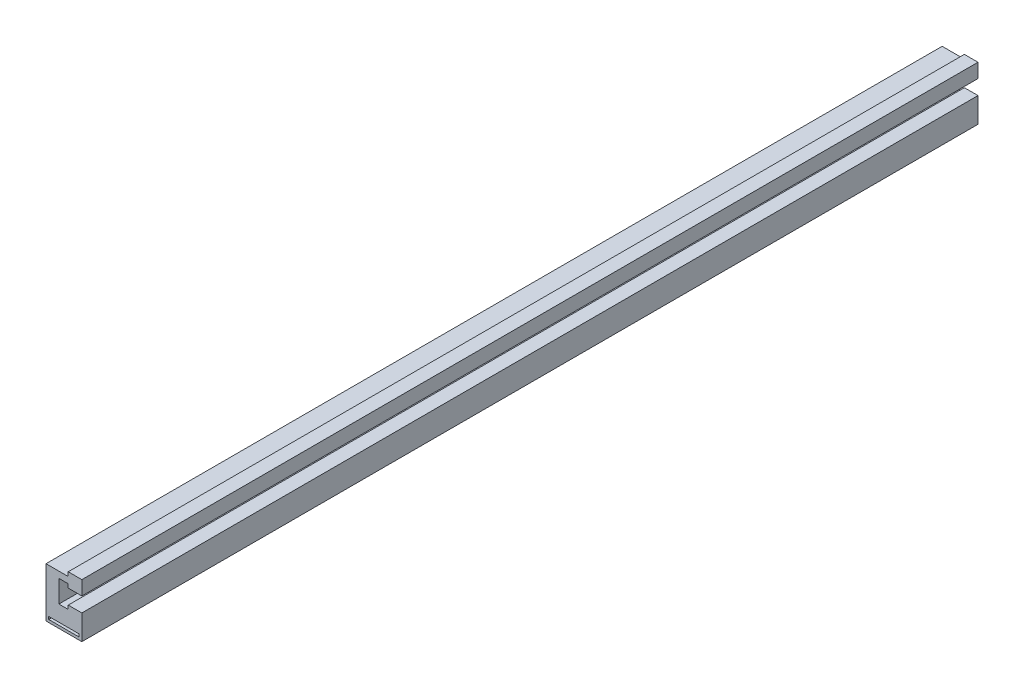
ISO-10303-21;
HEADER;
FILE_DESCRIPTION(('STEP AP214'),'2;1');
FILE_NAME('part.step','',(''),(''),'','','');
FILE_SCHEMA(('AUTOMOTIVE_DESIGN { 1 0 10303 214 1 1 1 1 }'));
ENDSEC;
DATA;
#1=APPLICATION_CONTEXT('core data for automotive mechanical design processes');
#2=APPLICATION_PROTOCOL_DEFINITION('international standard','automotive_design',2000,#1);
#3=PRODUCT_CONTEXT('',#1,'mechanical');
#4=PRODUCT('Part','Part','',(#3));
#5=PRODUCT_RELATED_PRODUCT_CATEGORY('part','',(#4));
#6=PRODUCT_DEFINITION_FORMATION('','',#4);
#7=PRODUCT_DEFINITION_CONTEXT('part definition',#1,'design');
#8=PRODUCT_DEFINITION('design','',#6,#7);
#9=PRODUCT_DEFINITION_SHAPE('','',#8);
#10=(LENGTH_UNIT() NAMED_UNIT(*) SI_UNIT(.MILLI.,.METRE.));
#11=(NAMED_UNIT(*) PLANE_ANGLE_UNIT() SI_UNIT($,.RADIAN.));
#12=(NAMED_UNIT(*) SI_UNIT($,.STERADIAN.) SOLID_ANGLE_UNIT());
#13=UNCERTAINTY_MEASURE_WITH_UNIT(LENGTH_MEASURE(1.E-05),#10,'distance_accuracy_value','');
#14=(GEOMETRIC_REPRESENTATION_CONTEXT(3) GLOBAL_UNCERTAINTY_ASSIGNED_CONTEXT((#13)) GLOBAL_UNIT_ASSIGNED_CONTEXT((#10,
#11,#12)) REPRESENTATION_CONTEXT('',''));
#15=CARTESIAN_POINT('',(0.,0.,0.));
#16=DIRECTION('',(0.,0.,1.));
#17=DIRECTION('',(1.,0.,0.));
#18=AXIS2_PLACEMENT_3D('',#15,#16,#17);
#19=CARTESIAN_POINT('',(10.,11.8,0.));
#20=DIRECTION('',(0.,0.,1.));
#21=DIRECTION('',(1.,0.,0.));
#22=AXIS2_PLACEMENT_3D('',#19,#20,#21);
#23=PLANE('',#22);
#24=DIRECTION('',(0.,1.,0.));
#25=VECTOR('',#24,1.);
#26=CARTESIAN_POINT('',(10.,22.1,0.));
#27=LINE('',#26,#25);
#28=CARTESIAN_POINT('',(10.,22.1,0.));
#29=VERTEX_POINT('',#28);
#30=CARTESIAN_POINT('',(10.,30.,0.));
#31=VERTEX_POINT('',#30);
#32=EDGE_CURVE('E216',#29,#31,#27,.T.);
#33=ORIENTED_EDGE('',*,*,#32,.F.);
#34=DIRECTION('',(-1.,0.,0.));
#35=VECTOR('',#34,1.);
#36=CARTESIAN_POINT('',(10.,22.1,0.));
#37=LINE('',#36,#35);
#38=CARTESIAN_POINT('',(2.39999999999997,22.1,0.));
#39=VERTEX_POINT('',#38);
#40=EDGE_CURVE('E255',#29,#39,#37,.T.);
#41=ORIENTED_EDGE('',*,*,#40,.T.);
#42=DIRECTION('',(0.,-1.,0.));
#43=VECTOR('',#42,1.);
#44=CARTESIAN_POINT('',(2.39999999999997,24.2,0.));
#45=LINE('',#44,#43);
#46=CARTESIAN_POINT('',(2.39999999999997,24.2,0.));
#47=VERTEX_POINT('',#46);
#48=EDGE_CURVE('E252',#47,#39,#45,.T.);
#49=ORIENTED_EDGE('',*,*,#48,.F.);
#50=DIRECTION('',(-1.,0.,0.));
#51=VECTOR('',#50,1.);
#52=CARTESIAN_POINT('',(2.39999999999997,24.2,0.));
#53=LINE('',#52,#51);
#54=CARTESIAN_POINT('',(-2.79999999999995,24.2,0.));
#55=VERTEX_POINT('',#54);
#56=EDGE_CURVE('E249',#47,#55,#53,.T.);
#57=ORIENTED_EDGE('',*,*,#56,.T.);
#58=DIRECTION('',(0.,-1.,0.));
#59=VECTOR('',#58,1.);
#60=CARTESIAN_POINT('',(-2.79999999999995,24.2,0.));
#61=LINE('',#60,#59);
#62=CARTESIAN_POINT('',(-2.79999999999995,11.8,0.));
#63=VERTEX_POINT('',#62);
#64=EDGE_CURVE('E246',#55,#63,#61,.T.);
#65=ORIENTED_EDGE('',*,*,#64,.T.);
#66=DIRECTION('',(-1.,0.,0.));
#67=VECTOR('',#66,1.);
#68=CARTESIAN_POINT('',(2.40000000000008,11.8,0.));
#69=LINE('',#68,#67);
#70=CARTESIAN_POINT('',(2.40000000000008,11.8,0.));
#71=VERTEX_POINT('',#70);
#72=EDGE_CURVE('E243',#71,#63,#69,.T.);
#73=ORIENTED_EDGE('',*,*,#72,.F.);
#74=DIRECTION('',(0.,-1.,0.));
#75=VECTOR('',#74,1.);
#76=CARTESIAN_POINT('',(2.39999999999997,13.9000000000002,0.));
#77=LINE('',#76,#75);
#78=CARTESIAN_POINT('',(2.39999999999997,13.9000000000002,0.));
#79=VERTEX_POINT('',#78);
#80=EDGE_CURVE('E240',#79,#71,#77,.T.);
#81=ORIENTED_EDGE('',*,*,#80,.F.);
#82=DIRECTION('',(-1.,0.,0.));
#83=VECTOR('',#82,1.);
#84=CARTESIAN_POINT('',(10.,13.9,0.));
#85=LINE('',#84,#83);
#86=CARTESIAN_POINT('',(10.,13.9,0.));
#87=VERTEX_POINT('',#86);
#88=EDGE_CURVE('E237',#87,#79,#85,.T.);
#89=ORIENTED_EDGE('',*,*,#88,.F.);
#90=DIRECTION('',(0.,1.,0.));
#91=VECTOR('',#90,1.);
#92=CARTESIAN_POINT('',(10.,0.,0.));
#93=LINE('',#92,#91);
#94=CARTESIAN_POINT('',(10.,0.,0.));
#95=VERTEX_POINT('',#94);
#96=EDGE_CURVE('E234',#95,#87,#93,.T.);
#97=ORIENTED_EDGE('',*,*,#96,.F.);
#98=DIRECTION('',(-1.,0.,0.));
#99=VECTOR('',#98,1.);
#100=CARTESIAN_POINT('',(10.,0.,0.));
#101=LINE('',#100,#99);
#102=CARTESIAN_POINT('',(-10.,0.,0.));
#103=VERTEX_POINT('',#102);
#104=EDGE_CURVE('E231',#95,#103,#101,.T.);
#105=ORIENTED_EDGE('',*,*,#104,.T.);
#106=DIRECTION('',(0.,1.,0.));
#107=VECTOR('',#106,1.);
#108=CARTESIAN_POINT('',(-10.,0.,0.));
#109=LINE('',#108,#107);
#110=CARTESIAN_POINT('',(-10.,27.7,0.));
#111=VERTEX_POINT('',#110);
#112=EDGE_CURVE('E228',#103,#111,#109,.T.);
#113=ORIENTED_EDGE('',*,*,#112,.T.);
#114=DIRECTION('',(-1.,0.,0.));
#115=VECTOR('',#114,1.);
#116=CARTESIAN_POINT('',(2.39999999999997,27.7,0.));
#117=LINE('',#116,#115);
#118=CARTESIAN_POINT('',(2.39999999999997,27.7,0.));
#119=VERTEX_POINT('',#118);
#120=EDGE_CURVE('E225',#119,#111,#117,.T.);
#121=ORIENTED_EDGE('',*,*,#120,.F.);
#122=DIRECTION('',(0.,1.,0.));
#123=VECTOR('',#122,1.);
#124=CARTESIAN_POINT('',(2.39999999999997,27.7,0.));
#125=LINE('',#124,#123);
#126=CARTESIAN_POINT('',(2.39999999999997,30.,0.));
#127=VERTEX_POINT('',#126);
#128=EDGE_CURVE('E222',#119,#127,#125,.T.);
#129=ORIENTED_EDGE('',*,*,#128,.T.);
#130=DIRECTION('',(-1.,0.,0.));
#131=VECTOR('',#130,1.);
#132=CARTESIAN_POINT('',(10.,30.,0.));
#133=LINE('',#132,#131);
#134=EDGE_CURVE('E219',#31,#127,#133,.T.);
#135=ORIENTED_EDGE('',*,*,#134,.F.);
#136=EDGE_LOOP('',(#33,#41,#49,#57,#65,#73,#81,#89,#97,#105,#113,#121,#129,#135));
#137=FACE_BOUND('',#136,.T.);
#138=DIRECTION('',(-1.,0.,0.));
#139=VECTOR('',#138,1.);
#140=CARTESIAN_POINT('',(8.50000000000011,1.49999999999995,0.));
#141=LINE('',#140,#139);
#142=CARTESIAN_POINT('',(8.50000000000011,1.49999999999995,0.));
#143=VERTEX_POINT('',#142);
#144=CARTESIAN_POINT('',(-8.5,1.50000000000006,0.));
#145=VERTEX_POINT('',#144);
#146=EDGE_CURVE('E140',#143,#145,#141,.T.);
#147=ORIENTED_EDGE('',*,*,#146,.F.);
#148=DIRECTION('',(0.,1.,0.));
#149=VECTOR('',#148,1.);
#150=CARTESIAN_POINT('',(8.50000000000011,1.49999999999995,0.));
#151=LINE('',#150,#149);
#152=CARTESIAN_POINT('',(8.50000000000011,2.99999999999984,0.));
#153=VERTEX_POINT('',#152);
#154=EDGE_CURVE('E167',#143,#153,#151,.T.);
#155=ORIENTED_EDGE('',*,*,#154,.T.);
#156=DIRECTION('',(-1.,0.,0.));
#157=VECTOR('',#156,1.);
#158=CARTESIAN_POINT('',(8.50000000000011,2.99999999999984,0.));
#159=LINE('',#158,#157);
#160=CARTESIAN_POINT('',(-8.5,2.99999999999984,0.));
#161=VERTEX_POINT('',#160);
#162=EDGE_CURVE('E29',#153,#161,#159,.T.);
#163=ORIENTED_EDGE('',*,*,#162,.T.);
#164=DIRECTION('',(0.,-1.,0.));
#165=VECTOR('',#164,1.);
#166=CARTESIAN_POINT('',(-8.5,2.99999999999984,0.));
#167=LINE('',#166,#165);
#168=EDGE_CURVE('E164',#161,#145,#167,.T.);
#169=ORIENTED_EDGE('',*,*,#168,.T.);
#170=EDGE_LOOP('',(#147,#155,#163,#169));
#171=FACE_BOUND('',#170,.T.);
#172=ADVANCED_FACE('F14',(#137,#171),#23,.F.);
#173=CARTESIAN_POINT('',(10.,11.8,500.));
#174=DIRECTION('',(0.,0.,1.));
#175=DIRECTION('',(1.,0.,0.));
#176=AXIS2_PLACEMENT_3D('',#173,#174,#175);
#177=PLANE('',#176);
#178=DIRECTION('',(0.,1.,0.));
#179=VECTOR('',#178,1.);
#180=CARTESIAN_POINT('',(10.,22.1,500.));
#181=LINE('',#180,#179);
#182=CARTESIAN_POINT('',(10.,22.1,500.));
#183=VERTEX_POINT('',#182);
#184=CARTESIAN_POINT('',(10.,30.,500.));
#185=VERTEX_POINT('',#184);
#186=EDGE_CURVE('E144',#183,#185,#181,.T.);
#187=ORIENTED_EDGE('',*,*,#186,.T.);
#188=DIRECTION('',(-1.,0.,0.));
#189=VECTOR('',#188,1.);
#190=CARTESIAN_POINT('',(10.,30.,500.));
#191=LINE('',#190,#189);
#192=CARTESIAN_POINT('',(2.39999999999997,30.,500.));
#193=VERTEX_POINT('',#192);
#194=EDGE_CURVE('E177',#185,#193,#191,.T.);
#195=ORIENTED_EDGE('',*,*,#194,.T.);
#196=DIRECTION('',(0.,1.,0.));
#197=VECTOR('',#196,1.);
#198=CARTESIAN_POINT('',(2.39999999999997,27.7,500.));
#199=LINE('',#198,#197);
#200=CARTESIAN_POINT('',(2.39999999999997,27.7,500.));
#201=VERTEX_POINT('',#200);
#202=EDGE_CURVE('E180',#201,#193,#199,.T.);
#203=ORIENTED_EDGE('',*,*,#202,.F.);
#204=DIRECTION('',(-1.,0.,0.));
#205=VECTOR('',#204,1.);
#206=CARTESIAN_POINT('',(2.39999999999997,27.7,500.));
#207=LINE('',#206,#205);
#208=CARTESIAN_POINT('',(-10.,27.7,500.));
#209=VERTEX_POINT('',#208);
#210=EDGE_CURVE('E183',#201,#209,#207,.T.);
#211=ORIENTED_EDGE('',*,*,#210,.T.);
#212=DIRECTION('',(0.,1.,0.));
#213=VECTOR('',#212,1.);
#214=CARTESIAN_POINT('',(-10.,0.,500.));
#215=LINE('',#214,#213);
#216=CARTESIAN_POINT('',(-10.,0.,500.));
#217=VERTEX_POINT('',#216);
#218=EDGE_CURVE('E186',#217,#209,#215,.T.);
#219=ORIENTED_EDGE('',*,*,#218,.F.);
#220=DIRECTION('',(-1.,0.,0.));
#221=VECTOR('',#220,1.);
#222=CARTESIAN_POINT('',(10.,0.,500.));
#223=LINE('',#222,#221);
#224=CARTESIAN_POINT('',(10.,0.,500.));
#225=VERTEX_POINT('',#224);
#226=EDGE_CURVE('E189',#225,#217,#223,.T.);
#227=ORIENTED_EDGE('',*,*,#226,.F.);
#228=DIRECTION('',(0.,1.,0.));
#229=VECTOR('',#228,1.);
#230=CARTESIAN_POINT('',(10.,0.,500.));
#231=LINE('',#230,#229);
#232=CARTESIAN_POINT('',(10.,13.9,500.));
#233=VERTEX_POINT('',#232);
#234=EDGE_CURVE('E192',#225,#233,#231,.T.);
#235=ORIENTED_EDGE('',*,*,#234,.T.);
#236=DIRECTION('',(-1.,0.,0.));
#237=VECTOR('',#236,1.);
#238=CARTESIAN_POINT('',(10.,13.9,500.));
#239=LINE('',#238,#237);
#240=CARTESIAN_POINT('',(2.39999999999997,13.9000000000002,500.));
#241=VERTEX_POINT('',#240);
#242=EDGE_CURVE('E195',#233,#241,#239,.T.);
#243=ORIENTED_EDGE('',*,*,#242,.T.);
#244=DIRECTION('',(0.,-1.,0.));
#245=VECTOR('',#244,1.);
#246=CARTESIAN_POINT('',(2.39999999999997,13.9000000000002,500.));
#247=LINE('',#246,#245);
#248=CARTESIAN_POINT('',(2.40000000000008,11.8,500.));
#249=VERTEX_POINT('',#248);
#250=EDGE_CURVE('E198',#241,#249,#247,.T.);
#251=ORIENTED_EDGE('',*,*,#250,.T.);
#252=DIRECTION('',(-1.,0.,0.));
#253=VECTOR('',#252,1.);
#254=CARTESIAN_POINT('',(2.40000000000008,11.8,500.));
#255=LINE('',#254,#253);
#256=CARTESIAN_POINT('',(-2.79999999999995,11.8,500.));
#257=VERTEX_POINT('',#256);
#258=EDGE_CURVE('E201',#249,#257,#255,.T.);
#259=ORIENTED_EDGE('',*,*,#258,.T.);
#260=DIRECTION('',(0.,-1.,0.));
#261=VECTOR('',#260,1.);
#262=CARTESIAN_POINT('',(-2.79999999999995,24.2,500.));
#263=LINE('',#262,#261);
#264=CARTESIAN_POINT('',(-2.79999999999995,24.2,500.));
#265=VERTEX_POINT('',#264);
#266=EDGE_CURVE('E204',#265,#257,#263,.T.);
#267=ORIENTED_EDGE('',*,*,#266,.F.);
#268=DIRECTION('',(-1.,0.,0.));
#269=VECTOR('',#268,1.);
#270=CARTESIAN_POINT('',(2.39999999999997,24.2,500.));
#271=LINE('',#270,#269);
#272=CARTESIAN_POINT('',(2.39999999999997,24.2,500.));
#273=VERTEX_POINT('',#272);
#274=EDGE_CURVE('E207',#273,#265,#271,.T.);
#275=ORIENTED_EDGE('',*,*,#274,.F.);
#276=DIRECTION('',(0.,-1.,0.));
#277=VECTOR('',#276,1.);
#278=CARTESIAN_POINT('',(2.39999999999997,24.2,500.));
#279=LINE('',#278,#277);
#280=CARTESIAN_POINT('',(2.39999999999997,22.1,500.));
#281=VERTEX_POINT('',#280);
#282=EDGE_CURVE('E210',#273,#281,#279,.T.);
#283=ORIENTED_EDGE('',*,*,#282,.T.);
#284=DIRECTION('',(-1.,0.,0.));
#285=VECTOR('',#284,1.);
#286=CARTESIAN_POINT('',(10.,22.1,500.));
#287=LINE('',#286,#285);
#288=EDGE_CURVE('E213',#183,#281,#287,.T.);
#289=ORIENTED_EDGE('',*,*,#288,.F.);
#290=EDGE_LOOP('',(#187,#195,#203,#211,#219,#227,#235,#243,#251,#259,#267,#275,#283,#289));
#291=FACE_BOUND('',#290,.T.);
#292=DIRECTION('',(0.,1.,0.));
#293=VECTOR('',#292,1.);
#294=CARTESIAN_POINT('',(8.50000000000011,1.49999999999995,500.));
#295=LINE('',#294,#293);
#296=CARTESIAN_POINT('',(8.50000000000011,1.49999999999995,500.));
#297=VERTEX_POINT('',#296);
#298=CARTESIAN_POINT('',(8.50000000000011,2.99999999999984,500.));
#299=VERTEX_POINT('',#298);
#300=EDGE_CURVE('E158',#297,#299,#295,.T.);
#301=ORIENTED_EDGE('',*,*,#300,.F.);
#302=DIRECTION('',(-1.,0.,0.));
#303=VECTOR('',#302,1.);
#304=CARTESIAN_POINT('',(8.50000000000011,1.49999999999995,500.));
#305=LINE('',#304,#303);
#306=CARTESIAN_POINT('',(-8.5,1.50000000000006,500.));
#307=VERTEX_POINT('',#306);
#308=EDGE_CURVE('E37',#297,#307,#305,.T.);
#309=ORIENTED_EDGE('',*,*,#308,.T.);
#310=DIRECTION('',(0.,-1.,0.));
#311=VECTOR('',#310,1.);
#312=CARTESIAN_POINT('',(-8.5,2.99999999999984,500.));
#313=LINE('',#312,#311);
#314=CARTESIAN_POINT('',(-8.5,2.99999999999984,500.));
#315=VERTEX_POINT('',#314);
#316=EDGE_CURVE('E148',#315,#307,#313,.T.);
#317=ORIENTED_EDGE('',*,*,#316,.F.);
#318=DIRECTION('',(-1.,0.,0.));
#319=VECTOR('',#318,1.);
#320=CARTESIAN_POINT('',(8.50000000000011,2.99999999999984,500.));
#321=LINE('',#320,#319);
#322=EDGE_CURVE('E153',#299,#315,#321,.T.);
#323=ORIENTED_EDGE('',*,*,#322,.F.);
#324=EDGE_LOOP('',(#301,#309,#317,#323));
#325=FACE_BOUND('',#324,.T.);
#326=ADVANCED_FACE('F156',(#291,#325),#177,.T.);
#327=CARTESIAN_POINT('',(10.,22.1,0.));
#328=DIRECTION('',(1.,0.,0.));
#329=DIRECTION('',(0.,0.,-1.));
#330=AXIS2_PLACEMENT_3D('',#327,#328,#329);
#331=PLANE('',#330);
#332=DIRECTION('',(0.,0.,1.));
#333=VECTOR('',#332,1.);
#334=CARTESIAN_POINT('',(10.,22.1,0.));
#335=LINE('',#334,#333);
#336=EDGE_CURVE('E9',#29,#183,#335,.T.);
#337=ORIENTED_EDGE('',*,*,#336,.F.);
#338=ORIENTED_EDGE('',*,*,#32,.T.);
#339=DIRECTION('',(0.,0.,1.));
#340=VECTOR('',#339,1.);
#341=CARTESIAN_POINT('',(10.,30.,0.));
#342=LINE('',#341,#340);
#343=EDGE_CURVE('E258',#31,#185,#342,.T.);
#344=ORIENTED_EDGE('',*,*,#343,.T.);
#345=ORIENTED_EDGE('',*,*,#186,.F.);
#346=EDGE_LOOP('',(#337,#338,#344,#345));
#347=FACE_BOUND('',#346,.T.);
#348=ADVANCED_FACE('F294',(#347),#331,.T.);
#349=CARTESIAN_POINT('',(10.,22.1,0.));
#350=DIRECTION('',(0.,1.,0.));
#351=DIRECTION('',(0.,0.,-1.));
#352=AXIS2_PLACEMENT_3D('',#349,#350,#351);
#353=PLANE('',#352);
#354=DIRECTION('',(0.,0.,1.));
#355=VECTOR('',#354,1.);
#356=CARTESIAN_POINT('',(2.39999999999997,22.1,0.));
#357=LINE('',#356,#355);
#358=EDGE_CURVE('E22',#39,#281,#357,.T.);
#359=ORIENTED_EDGE('',*,*,#358,.F.);
#360=ORIENTED_EDGE('',*,*,#40,.F.);
#361=ORIENTED_EDGE('',*,*,#336,.T.);
#362=ORIENTED_EDGE('',*,*,#288,.T.);
#363=EDGE_LOOP('',(#359,#360,#361,#362));
#364=FACE_BOUND('',#363,.T.);
#365=ADVANCED_FACE('F16',(#364),#353,.F.);
#366=CARTESIAN_POINT('',(2.39999999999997,24.2,0.));
#367=DIRECTION('',(-1.,0.,0.));
#368=DIRECTION('',(0.,0.,1.));
#369=AXIS2_PLACEMENT_3D('',#366,#367,#368);
#370=PLANE('',#369);
#371=DIRECTION('',(0.,0.,1.));
#372=VECTOR('',#371,1.);
#373=CARTESIAN_POINT('',(2.39999999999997,24.2,0.));
#374=LINE('',#373,#372);
#375=EDGE_CURVE('E280',#47,#273,#374,.T.);
#376=ORIENTED_EDGE('',*,*,#375,.F.);
#377=ORIENTED_EDGE('',*,*,#48,.T.);
#378=ORIENTED_EDGE('',*,*,#358,.T.);
#379=ORIENTED_EDGE('',*,*,#282,.F.);
#380=EDGE_LOOP('',(#376,#377,#378,#379));
#381=FACE_BOUND('',#380,.T.);
#382=ADVANCED_FACE('F283',(#381),#370,.T.);
#383=CARTESIAN_POINT('',(2.39999999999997,24.2,0.));
#384=DIRECTION('',(0.,1.,0.));
#385=DIRECTION('',(0.,0.,-1.));
#386=AXIS2_PLACEMENT_3D('',#383,#384,#385);
#387=PLANE('',#386);
#388=DIRECTION('',(0.,0.,1.));
#389=VECTOR('',#388,1.);
#390=CARTESIAN_POINT('',(-2.79999999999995,24.2,0.));
#391=LINE('',#390,#389);
#392=EDGE_CURVE('E278',#55,#265,#391,.T.);
#393=ORIENTED_EDGE('',*,*,#392,.F.);
#394=ORIENTED_EDGE('',*,*,#56,.F.);
#395=ORIENTED_EDGE('',*,*,#375,.T.);
#396=ORIENTED_EDGE('',*,*,#274,.T.);
#397=EDGE_LOOP('',(#393,#394,#395,#396));
#398=FACE_BOUND('',#397,.T.);
#399=ADVANCED_FACE('F335',(#398),#387,.F.);
#400=CARTESIAN_POINT('',(-2.79999999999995,24.2,0.));
#401=DIRECTION('',(-1.,0.,0.));
#402=DIRECTION('',(0.,0.,1.));
#403=AXIS2_PLACEMENT_3D('',#400,#401,#402);
#404=PLANE('',#403);
#405=DIRECTION('',(0.,0.,1.));
#406=VECTOR('',#405,1.);
#407=CARTESIAN_POINT('',(-2.79999999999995,11.8,0.));
#408=LINE('',#407,#406);
#409=EDGE_CURVE('E276',#63,#257,#408,.T.);
#410=ORIENTED_EDGE('',*,*,#409,.F.);
#411=ORIENTED_EDGE('',*,*,#64,.F.);
#412=ORIENTED_EDGE('',*,*,#392,.T.);
#413=ORIENTED_EDGE('',*,*,#266,.T.);
#414=EDGE_LOOP('',(#410,#411,#412,#413));
#415=FACE_BOUND('',#414,.T.);
#416=ADVANCED_FACE('F333',(#415),#404,.F.);
#417=CARTESIAN_POINT('',(2.40000000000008,11.8,0.));
#418=DIRECTION('',(0.,1.,0.));
#419=DIRECTION('',(0.,0.,-1.));
#420=AXIS2_PLACEMENT_3D('',#417,#418,#419);
#421=PLANE('',#420);
#422=DIRECTION('',(0.,0.,1.));
#423=VECTOR('',#422,1.);
#424=CARTESIAN_POINT('',(2.40000000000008,11.8,0.));
#425=LINE('',#424,#423);
#426=EDGE_CURVE('E274',#71,#249,#425,.T.);
#427=ORIENTED_EDGE('',*,*,#426,.F.);
#428=ORIENTED_EDGE('',*,*,#72,.T.);
#429=ORIENTED_EDGE('',*,*,#409,.T.);
#430=ORIENTED_EDGE('',*,*,#258,.F.);
#431=EDGE_LOOP('',(#427,#428,#429,#430));
#432=FACE_BOUND('',#431,.T.);
#433=ADVANCED_FACE('F330',(#432),#421,.T.);
#434=CARTESIAN_POINT('',(2.39999999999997,13.9000000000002,0.));
#435=DIRECTION('',(-1.,0.,0.));
#436=DIRECTION('',(0.,1.,0.));
#437=AXIS2_PLACEMENT_3D('',#434,#435,#436);
#438=PLANE('',#437);
#439=DIRECTION('',(0.,0.,1.));
#440=VECTOR('',#439,1.);
#441=CARTESIAN_POINT('',(2.39999999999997,13.9000000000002,0.));
#442=LINE('',#441,#440);
#443=EDGE_CURVE('E272',#79,#241,#442,.T.);
#444=ORIENTED_EDGE('',*,*,#443,.F.);
#445=ORIENTED_EDGE('',*,*,#80,.T.);
#446=ORIENTED_EDGE('',*,*,#426,.T.);
#447=ORIENTED_EDGE('',*,*,#250,.F.);
#448=EDGE_LOOP('',(#444,#445,#446,#447));
#449=FACE_BOUND('',#448,.T.);
#450=ADVANCED_FACE('F326',(#449),#438,.T.);
#451=CARTESIAN_POINT('',(10.,13.9,0.));
#452=DIRECTION('',(0.,1.,0.));
#453=DIRECTION('',(1.,0.,0.));
#454=AXIS2_PLACEMENT_3D('',#451,#452,#453);
#455=PLANE('',#454);
#456=DIRECTION('',(0.,0.,1.));
#457=VECTOR('',#456,1.);
#458=CARTESIAN_POINT('',(10.,13.9,0.));
#459=LINE('',#458,#457);
#460=EDGE_CURVE('E270',#87,#233,#459,.T.);
#461=ORIENTED_EDGE('',*,*,#460,.F.);
#462=ORIENTED_EDGE('',*,*,#88,.T.);
#463=ORIENTED_EDGE('',*,*,#443,.T.);
#464=ORIENTED_EDGE('',*,*,#242,.F.);
#465=EDGE_LOOP('',(#461,#462,#463,#464));
#466=FACE_BOUND('',#465,.T.);
#467=ADVANCED_FACE('F323',(#466),#455,.T.);
#468=CARTESIAN_POINT('',(10.,0.,0.));
#469=DIRECTION('',(1.,0.,0.));
#470=DIRECTION('',(0.,0.,-1.));
#471=AXIS2_PLACEMENT_3D('',#468,#469,#470);
#472=PLANE('',#471);
#473=DIRECTION('',(0.,0.,1.));
#474=VECTOR('',#473,1.);
#475=CARTESIAN_POINT('',(10.,0.,0.));
#476=LINE('',#475,#474);
#477=EDGE_CURVE('E268',#95,#225,#476,.T.);
#478=ORIENTED_EDGE('',*,*,#477,.F.);
#479=ORIENTED_EDGE('',*,*,#96,.T.);
#480=ORIENTED_EDGE('',*,*,#460,.T.);
#481=ORIENTED_EDGE('',*,*,#234,.F.);
#482=EDGE_LOOP('',(#478,#479,#480,#481));
#483=FACE_BOUND('',#482,.T.);
#484=ADVANCED_FACE('F318',(#483),#472,.T.);
#485=CARTESIAN_POINT('',(10.,0.,0.));
#486=DIRECTION('',(0.,1.,0.));
#487=DIRECTION('',(1.,0.,0.));
#488=AXIS2_PLACEMENT_3D('',#485,#486,#487);
#489=PLANE('',#488);
#490=DIRECTION('',(0.,0.,1.));
#491=VECTOR('',#490,1.);
#492=CARTESIAN_POINT('',(-10.,0.,0.));
#493=LINE('',#492,#491);
#494=EDGE_CURVE('E266',#103,#217,#493,.T.);
#495=ORIENTED_EDGE('',*,*,#494,.F.);
#496=ORIENTED_EDGE('',*,*,#104,.F.);
#497=ORIENTED_EDGE('',*,*,#477,.T.);
#498=ORIENTED_EDGE('',*,*,#226,.T.);
#499=EDGE_LOOP('',(#495,#496,#497,#498));
#500=FACE_BOUND('',#499,.T.);
#501=ADVANCED_FACE('F314',(#500),#489,.F.);
#502=CARTESIAN_POINT('',(-10.,0.,0.));
#503=DIRECTION('',(1.,0.,0.));
#504=DIRECTION('',(0.,0.,-1.));
#505=AXIS2_PLACEMENT_3D('',#502,#503,#504);
#506=PLANE('',#505);
#507=DIRECTION('',(0.,0.,1.));
#508=VECTOR('',#507,1.);
#509=CARTESIAN_POINT('',(-10.,27.7,0.));
#510=LINE('',#509,#508);
#511=EDGE_CURVE('E264',#111,#209,#510,.T.);
#512=ORIENTED_EDGE('',*,*,#511,.F.);
#513=ORIENTED_EDGE('',*,*,#112,.F.);
#514=ORIENTED_EDGE('',*,*,#494,.T.);
#515=ORIENTED_EDGE('',*,*,#218,.T.);
#516=EDGE_LOOP('',(#512,#513,#514,#515));
#517=FACE_BOUND('',#516,.T.);
#518=ADVANCED_FACE('F310',(#517),#506,.F.);
#519=CARTESIAN_POINT('',(2.39999999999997,27.7,0.));
#520=DIRECTION('',(0.,1.,0.));
#521=DIRECTION('',(1.,0.,0.));
#522=AXIS2_PLACEMENT_3D('',#519,#520,#521);
#523=PLANE('',#522);
#524=DIRECTION('',(0.,0.,1.));
#525=VECTOR('',#524,1.);
#526=CARTESIAN_POINT('',(2.39999999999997,27.7,0.));
#527=LINE('',#526,#525);
#528=EDGE_CURVE('E262',#119,#201,#527,.T.);
#529=ORIENTED_EDGE('',*,*,#528,.F.);
#530=ORIENTED_EDGE('',*,*,#120,.T.);
#531=ORIENTED_EDGE('',*,*,#511,.T.);
#532=ORIENTED_EDGE('',*,*,#210,.F.);
#533=EDGE_LOOP('',(#529,#530,#531,#532));
#534=FACE_BOUND('',#533,.T.);
#535=ADVANCED_FACE('F307',(#534),#523,.T.);
#536=CARTESIAN_POINT('',(2.39999999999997,27.7,0.));
#537=DIRECTION('',(1.,0.,0.));
#538=DIRECTION('',(0.,0.,-1.));
#539=AXIS2_PLACEMENT_3D('',#536,#537,#538);
#540=PLANE('',#539);
#541=DIRECTION('',(0.,0.,1.));
#542=VECTOR('',#541,1.);
#543=CARTESIAN_POINT('',(2.39999999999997,30.,0.));
#544=LINE('',#543,#542);
#545=EDGE_CURVE('E260',#127,#193,#544,.T.);
#546=ORIENTED_EDGE('',*,*,#545,.F.);
#547=ORIENTED_EDGE('',*,*,#128,.F.);
#548=ORIENTED_EDGE('',*,*,#528,.T.);
#549=ORIENTED_EDGE('',*,*,#202,.T.);
#550=EDGE_LOOP('',(#546,#547,#548,#549));
#551=FACE_BOUND('',#550,.T.);
#552=ADVANCED_FACE('F302',(#551),#540,.F.);
#553=CARTESIAN_POINT('',(10.,30.,0.));
#554=DIRECTION('',(0.,1.,0.));
#555=DIRECTION('',(1.,0.,0.));
#556=AXIS2_PLACEMENT_3D('',#553,#554,#555);
#557=PLANE('',#556);
#558=ORIENTED_EDGE('',*,*,#134,.T.);
#559=ORIENTED_EDGE('',*,*,#545,.T.);
#560=ORIENTED_EDGE('',*,*,#194,.F.);
#561=ORIENTED_EDGE('',*,*,#343,.F.);
#562=EDGE_LOOP('',(#558,#559,#560,#561));
#563=FACE_BOUND('',#562,.T.);
#564=ADVANCED_FACE('F298',(#563),#557,.T.);
#565=CARTESIAN_POINT('',(8.50000000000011,1.49999999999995,0.));
#566=DIRECTION('',(0.,1.,0.));
#567=DIRECTION('',(1.,0.,0.));
#568=AXIS2_PLACEMENT_3D('',#565,#566,#567);
#569=PLANE('',#568);
#570=DIRECTION('',(0.,0.,1.));
#571=VECTOR('',#570,1.);
#572=CARTESIAN_POINT('',(-8.5,1.50000000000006,0.));
#573=LINE('',#572,#571);
#574=EDGE_CURVE('E136',#145,#307,#573,.T.);
#575=ORIENTED_EDGE('',*,*,#574,.T.);
#576=ORIENTED_EDGE('',*,*,#308,.F.);
#577=DIRECTION('',(0.,0.,1.));
#578=VECTOR('',#577,1.);
#579=CARTESIAN_POINT('',(8.50000000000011,1.49999999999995,0.));
#580=LINE('',#579,#578);
#581=EDGE_CURVE('E170',#143,#297,#580,.T.);
#582=ORIENTED_EDGE('',*,*,#581,.F.);
#583=ORIENTED_EDGE('',*,*,#146,.T.);
#584=EDGE_LOOP('',(#575,#576,#582,#583));
#585=FACE_BOUND('',#584,.T.);
#586=ADVANCED_FACE('F138',(#585),#569,.T.);
#587=CARTESIAN_POINT('',(-8.5,2.99999999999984,0.));
#588=DIRECTION('',(-1.,0.,0.));
#589=DIRECTION('',(0.,0.,1.));
#590=AXIS2_PLACEMENT_3D('',#587,#588,#589);
#591=PLANE('',#590);
#592=DIRECTION('',(0.,0.,1.));
#593=VECTOR('',#592,1.);
#594=CARTESIAN_POINT('',(-8.5,2.99999999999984,0.));
#595=LINE('',#594,#593);
#596=EDGE_CURVE('E145',#161,#315,#595,.T.);
#597=ORIENTED_EDGE('',*,*,#596,.T.);
#598=ORIENTED_EDGE('',*,*,#316,.T.);
#599=ORIENTED_EDGE('',*,*,#574,.F.);
#600=ORIENTED_EDGE('',*,*,#168,.F.);
#601=EDGE_LOOP('',(#597,#598,#599,#600));
#602=FACE_BOUND('',#601,.T.);
#603=ADVANCED_FACE('F149',(#602),#591,.F.);
#604=CARTESIAN_POINT('',(8.50000000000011,2.99999999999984,0.));
#605=DIRECTION('',(0.,1.,0.));
#606=DIRECTION('',(0.,0.,-1.));
#607=AXIS2_PLACEMENT_3D('',#604,#605,#606);
#608=PLANE('',#607);
#609=DIRECTION('',(0.,0.,1.));
#610=VECTOR('',#609,1.);
#611=CARTESIAN_POINT('',(8.50000000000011,2.99999999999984,0.));
#612=LINE('',#611,#610);
#613=EDGE_CURVE('E172',#153,#299,#612,.T.);
#614=ORIENTED_EDGE('',*,*,#613,.T.);
#615=ORIENTED_EDGE('',*,*,#322,.T.);
#616=ORIENTED_EDGE('',*,*,#596,.F.);
#617=ORIENTED_EDGE('',*,*,#162,.F.);
#618=EDGE_LOOP('',(#614,#615,#616,#617));
#619=FACE_BOUND('',#618,.T.);
#620=ADVANCED_FACE('F344',(#619),#608,.F.);
#621=CARTESIAN_POINT('',(8.50000000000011,1.49999999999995,0.));
#622=DIRECTION('',(1.,0.,0.));
#623=DIRECTION('',(0.,0.,-1.));
#624=AXIS2_PLACEMENT_3D('',#621,#622,#623);
#625=PLANE('',#624);
#626=ORIENTED_EDGE('',*,*,#154,.F.);
#627=ORIENTED_EDGE('',*,*,#581,.T.);
#628=ORIENTED_EDGE('',*,*,#300,.T.);
#629=ORIENTED_EDGE('',*,*,#613,.F.);
#630=EDGE_LOOP('',(#626,#627,#628,#629));
#631=FACE_BOUND('',#630,.T.);
#632=ADVANCED_FACE('F343',(#631),#625,.F.);
#633=CLOSED_SHELL('',(#172,#326,#348,#365,#382,#399,#416,#433,#450,#467,#484,#501,#518,#535,
#552,#564,#586,#603,#620,#632));
#634=MANIFOLD_SOLID_BREP('B1',#633);
#635=ADVANCED_BREP_SHAPE_REPRESENTATION('',(#18,#634),#14);
#636=SHAPE_DEFINITION_REPRESENTATION(#9,#635);
ENDSEC;
END-ISO-10303-21;
